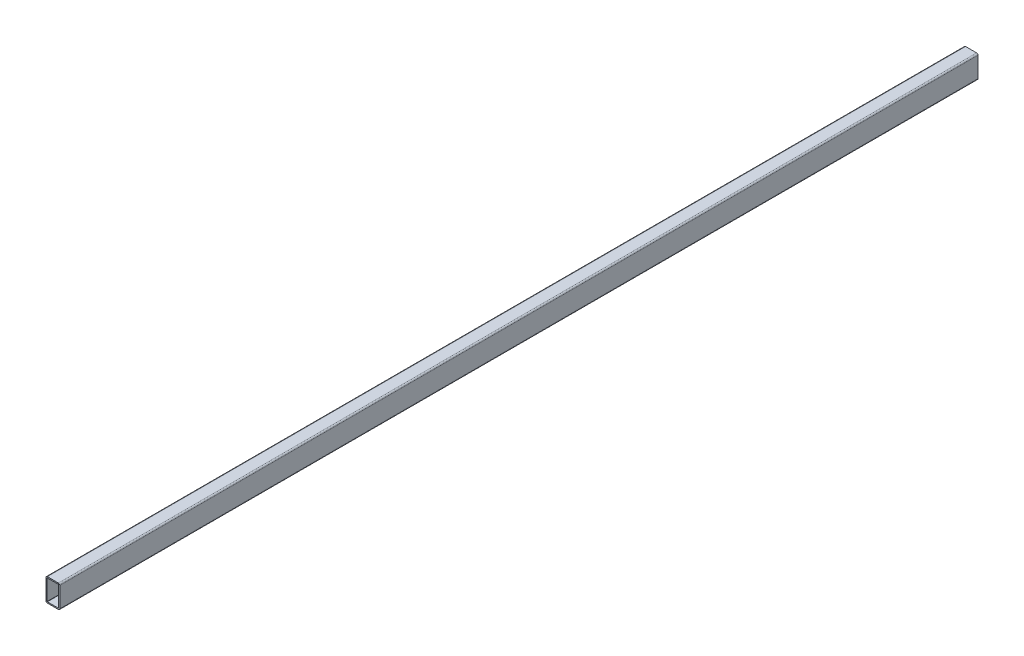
from build123d import *

# Parameters (mm, degrees)
EXTRUDE_1_DEPTH = 2000


with BuildPart() as part:
    # Sketch 1 → Extrude 1 (new body)
    with BuildSketch(Plane.XY):
        with BuildLine():
            Line((-3, 0), (-27, 0))
            ThreePointArc((-27, 0), (-29.121320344, -0.878679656), (-30, -3))
            Line((-30, -3), (-30, -47))
            ThreePointArc((-30, -47), (-29.121320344, -49.121320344), (-27, -50))
            Line((-27, -50), (-3, -50))
            ThreePointArc((-3, -50), (-0.878679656, -49.121320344), (0, -47))
            Line((0, -47), (0, -3))
            ThreePointArc((0, -3), (-0.878679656, -0.878679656), (-3, 0))
        make_face()
        with BuildLine():
            Line((-3, -2.5), (-27, -2.5))
            ThreePointArc((-27, -2.5), (-27.353553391, -2.646446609), (-27.5, -3))
            Line((-27.5, -3), (-27.5, -47))
            ThreePointArc((-27.5, -47), (-27.353553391, -47.353553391), (-27, -47.5))
            Line((-27, -47.5), (-3, -47.5))
            ThreePointArc((-3, -47.5), (-2.646446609, -47.353553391), (-2.5, -47))
            Line((-2.5, -47), (-2.5, -3))
            ThreePointArc((-2.5, -3), (-2.646446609, -2.646446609), (-3, -2.5))
        make_face(mode=Mode.SUBTRACT)
    extrude(amount=EXTRUDE_1_DEPTH)


solid = part.part
